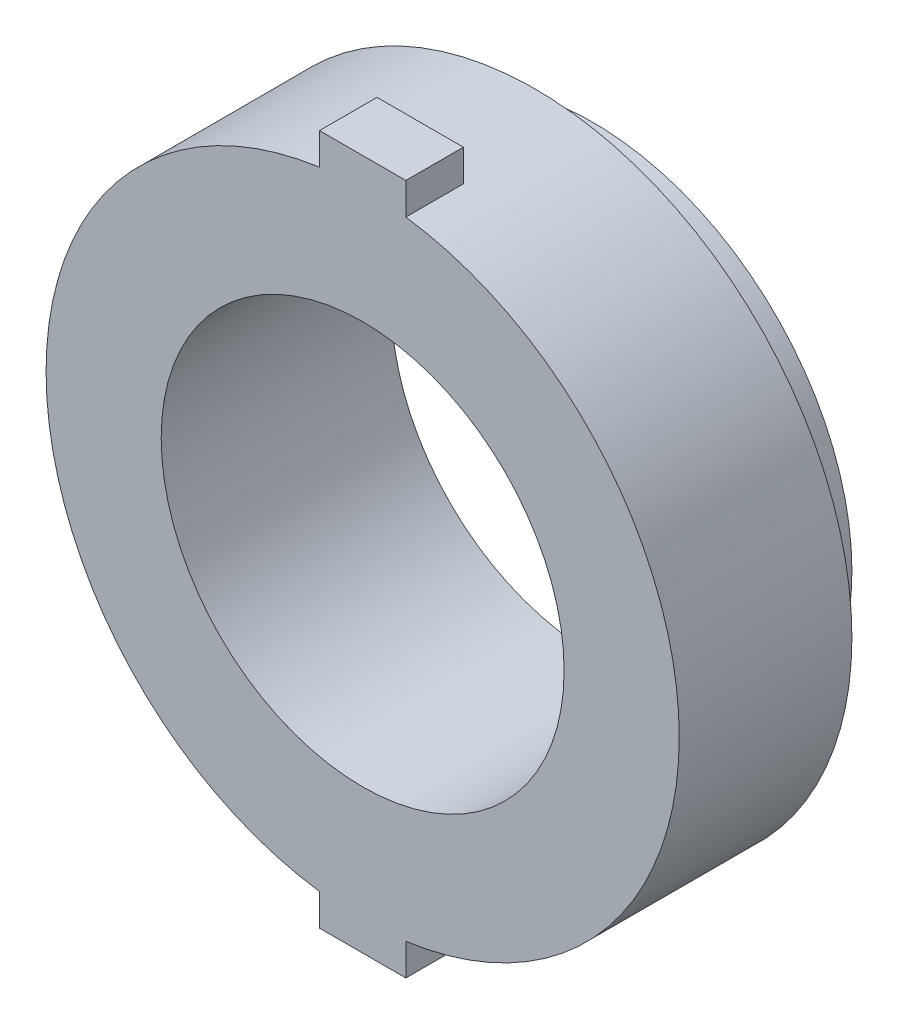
ISO-10303-21;
HEADER;
FILE_DESCRIPTION(('STEP AP214'),'2;1');
FILE_NAME('part.step','',(''),(''),'','','');
FILE_SCHEMA(('AUTOMOTIVE_DESIGN { 1 0 10303 214 1 1 1 1 }'));
ENDSEC;
DATA;
#1=APPLICATION_CONTEXT('core data for automotive mechanical design processes');
#2=APPLICATION_PROTOCOL_DEFINITION('international standard','automotive_design',2000,#1);
#3=PRODUCT_CONTEXT('',#1,'mechanical');
#4=PRODUCT('Part','Part','',(#3));
#5=PRODUCT_RELATED_PRODUCT_CATEGORY('part','',(#4));
#6=PRODUCT_DEFINITION_FORMATION('','',#4);
#7=PRODUCT_DEFINITION_CONTEXT('part definition',#1,'design');
#8=PRODUCT_DEFINITION('design','',#6,#7);
#9=PRODUCT_DEFINITION_SHAPE('','',#8);
#10=(LENGTH_UNIT() NAMED_UNIT(*) SI_UNIT(.MILLI.,.METRE.));
#11=(NAMED_UNIT(*) PLANE_ANGLE_UNIT() SI_UNIT($,.RADIAN.));
#12=(NAMED_UNIT(*) SI_UNIT($,.STERADIAN.) SOLID_ANGLE_UNIT());
#13=UNCERTAINTY_MEASURE_WITH_UNIT(LENGTH_MEASURE(1.E-05),#10,'distance_accuracy_value','');
#14=(GEOMETRIC_REPRESENTATION_CONTEXT(3) GLOBAL_UNCERTAINTY_ASSIGNED_CONTEXT((#13)) GLOBAL_UNIT_ASSIGNED_CONTEXT((#10,
#11,#12)) REPRESENTATION_CONTEXT('',''));
#15=CARTESIAN_POINT('',(0.,0.,0.));
#16=DIRECTION('',(0.,0.,1.));
#17=DIRECTION('',(1.,0.,0.));
#18=AXIS2_PLACEMENT_3D('',#15,#16,#17);
#19=CARTESIAN_POINT('',(0.,0.,0.));
#20=DIRECTION('',(0.,0.,1.));
#21=DIRECTION('',(1.,0.,0.));
#22=AXIS2_PLACEMENT_3D('',#19,#20,#21);
#23=PLANE('',#22);
#24=CARTESIAN_POINT('',(0.,0.,0.));
#25=DIRECTION('',(0.,0.,1.));
#26=DIRECTION('',(1.,0.,0.));
#27=AXIS2_PLACEMENT_3D('',#24,#25,#26);
#28=CIRCLE('',#27,5.5);
#29=CARTESIAN_POINT('',(5.5,0.,0.));
#30=VERTEX_POINT('',#29);
#31=EDGE_CURVE('E149',#30,#30,#28,.T.);
#32=ORIENTED_EDGE('',*,*,#31,.F.);
#33=EDGE_LOOP('',(#32));
#34=FACE_BOUND('',#33,.T.);
#35=CARTESIAN_POINT('',(0.,0.,0.));
#36=DIRECTION('',(0.,0.,1.));
#37=DIRECTION('',(1.,0.,0.));
#38=AXIS2_PLACEMENT_3D('',#35,#36,#37);
#39=CIRCLE('',#38,4.5);
#40=CARTESIAN_POINT('',(4.5,0.,0.));
#41=VERTEX_POINT('',#40);
#42=EDGE_CURVE('E11',#41,#41,#39,.F.);
#43=ORIENTED_EDGE('',*,*,#42,.F.);
#44=EDGE_LOOP('',(#43));
#45=FACE_BOUND('',#44,.T.);
#46=ADVANCED_FACE('F32',(#34,#45),#23,.F.);
#47=CARTESIAN_POINT('',(0.,0.,3.));
#48=DIRECTION('',(0.,0.,1.));
#49=DIRECTION('',(1.,0.,0.));
#50=AXIS2_PLACEMENT_3D('',#47,#48,#49);
#51=PLANE('',#50);
#52=CARTESIAN_POINT('',(0.,0.,3.));
#53=DIRECTION('',(0.,0.,1.));
#54=DIRECTION('',(1.,0.,0.));
#55=AXIS2_PLACEMENT_3D('',#52,#53,#54);
#56=CIRCLE('',#55,5.5);
#57=CARTESIAN_POINT('',(-0.750000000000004,5.44862367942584,3.));
#58=VERTEX_POINT('',#57);
#59=CARTESIAN_POINT('',(-0.750000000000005,-5.44862367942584,3.));
#60=VERTEX_POINT('',#59);
#61=EDGE_CURVE('E103',#58,#60,#56,.T.);
#62=ORIENTED_EDGE('',*,*,#61,.T.);
#63=DIRECTION('',(0.,-1.,0.));
#64=VECTOR('',#63,1.);
#65=CARTESIAN_POINT('',(-0.750000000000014,-4.25651707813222,3.));
#66=LINE('',#65,#64);
#67=CARTESIAN_POINT('',(-0.75,-6.,3.));
#68=VERTEX_POINT('',#67);
#69=EDGE_CURVE('E96',#60,#68,#66,.T.);
#70=ORIENTED_EDGE('',*,*,#69,.T.);
#71=DIRECTION('',(1.,0.,0.));
#72=VECTOR('',#71,1.);
#73=CARTESIAN_POINT('',(-0.75,-6.,3.));
#74=LINE('',#73,#72);
#75=CARTESIAN_POINT('',(0.749999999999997,-6.,3.));
#76=VERTEX_POINT('',#75);
#77=EDGE_CURVE('E101',#68,#76,#74,.T.);
#78=ORIENTED_EDGE('',*,*,#77,.T.);
#79=DIRECTION('',(0.,1.,0.));
#80=VECTOR('',#79,1.);
#81=CARTESIAN_POINT('',(0.749999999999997,-6.,3.));
#82=LINE('',#81,#80);
#83=CARTESIAN_POINT('',(0.749999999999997,-5.44862367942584,3.));
#84=VERTEX_POINT('',#83);
#85=EDGE_CURVE('E47',#76,#84,#82,.T.);
#86=ORIENTED_EDGE('',*,*,#85,.T.);
#87=CARTESIAN_POINT('',(0.749999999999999,5.44862367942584,3.));
#88=VERTEX_POINT('',#87);
#89=EDGE_CURVE('E152',#84,#88,#56,.T.);
#90=ORIENTED_EDGE('',*,*,#89,.T.);
#91=DIRECTION('',(0.,1.,0.));
#92=VECTOR('',#91,1.);
#93=CARTESIAN_POINT('',(0.749999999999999,6.,3.));
#94=LINE('',#93,#92);
#95=CARTESIAN_POINT('',(0.749999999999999,6.,3.));
#96=VERTEX_POINT('',#95);
#97=EDGE_CURVE('E129',#88,#96,#94,.T.);
#98=ORIENTED_EDGE('',*,*,#97,.T.);
#99=DIRECTION('',(-1.,0.,0.));
#100=VECTOR('',#99,1.);
#101=CARTESIAN_POINT('',(-0.749999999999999,6.,3.));
#102=LINE('',#101,#100);
#103=CARTESIAN_POINT('',(-0.749999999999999,6.,3.));
#104=VERTEX_POINT('',#103);
#105=EDGE_CURVE('E131',#96,#104,#102,.T.);
#106=ORIENTED_EDGE('',*,*,#105,.T.);
#107=DIRECTION('',(0.,-1.,0.));
#108=VECTOR('',#107,1.);
#109=CARTESIAN_POINT('',(-0.750000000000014,4.47203693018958,3.));
#110=LINE('',#109,#108);
#111=EDGE_CURVE('E54',#104,#58,#110,.T.);
#112=ORIENTED_EDGE('',*,*,#111,.T.);
#113=EDGE_LOOP('',(#62,#70,#78,#86,#90,#98,#106,#112));
#114=FACE_BOUND('',#113,.T.);
#115=CARTESIAN_POINT('',(0.,0.,3.));
#116=DIRECTION('',(0.,0.,1.));
#117=DIRECTION('',(1.,0.,0.));
#118=AXIS2_PLACEMENT_3D('',#115,#116,#117);
#119=CIRCLE('',#118,3.5);
#120=CARTESIAN_POINT('',(3.5,0.,3.));
#121=VERTEX_POINT('',#120);
#122=EDGE_CURVE('E144',#121,#121,#119,.T.);
#123=ORIENTED_EDGE('',*,*,#122,.F.);
#124=EDGE_LOOP('',(#123));
#125=FACE_BOUND('',#124,.T.);
#126=ADVANCED_FACE('F98',(#114,#125),#51,.T.);
#127=CARTESIAN_POINT('',(0.,0.,3.));
#128=DIRECTION('',(0.,0.,-1.));
#129=DIRECTION('',(-1.,0.,0.));
#130=AXIS2_PLACEMENT_3D('',#127,#128,#129);
#131=CYLINDRICAL_SURFACE('',#130,5.5);
#132=ORIENTED_EDGE('',*,*,#89,.F.);
#133=DIRECTION('',(0.,0.,-1.));
#134=VECTOR('',#133,1.);
#135=CARTESIAN_POINT('',(0.749999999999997,-5.44862367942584,3.));
#136=LINE('',#135,#134);
#137=CARTESIAN_POINT('',(0.749999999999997,-5.44862367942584,2.));
#138=VERTEX_POINT('',#137);
#139=EDGE_CURVE('E40',#84,#138,#136,.T.);
#140=ORIENTED_EDGE('',*,*,#139,.T.);
#141=CARTESIAN_POINT('',(0.,0.,2.));
#142=DIRECTION('',(0.,0.,-1.));
#143=DIRECTION('',(-1.,0.,0.));
#144=AXIS2_PLACEMENT_3D('',#141,#142,#143);
#145=CIRCLE('',#144,5.5);
#146=CARTESIAN_POINT('',(-0.750000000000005,-5.44862367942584,2.));
#147=VERTEX_POINT('',#146);
#148=EDGE_CURVE('E162',#138,#147,#145,.T.);
#149=ORIENTED_EDGE('',*,*,#148,.T.);
#150=DIRECTION('',(0.,0.,-1.));
#151=VECTOR('',#150,1.);
#152=CARTESIAN_POINT('',(-0.750000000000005,-5.44862367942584,3.));
#153=LINE('',#152,#151);
#154=EDGE_CURVE('E165',#147,#60,#153,.F.);
#155=ORIENTED_EDGE('',*,*,#154,.T.);
#156=ORIENTED_EDGE('',*,*,#61,.F.);
#157=DIRECTION('',(0.,0.,-1.));
#158=VECTOR('',#157,1.);
#159=CARTESIAN_POINT('',(-0.750000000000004,5.44862367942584,3.));
#160=LINE('',#159,#158);
#161=CARTESIAN_POINT('',(-0.750000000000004,5.44862367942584,2.));
#162=VERTEX_POINT('',#161);
#163=EDGE_CURVE('E159',#58,#162,#160,.T.);
#164=ORIENTED_EDGE('',*,*,#163,.T.);
#165=CARTESIAN_POINT('',(0.,0.,2.));
#166=DIRECTION('',(0.,0.,1.));
#167=DIRECTION('',(1.,0.,0.));
#168=AXIS2_PLACEMENT_3D('',#165,#166,#167);
#169=CIRCLE('',#168,5.5);
#170=CARTESIAN_POINT('',(0.749999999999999,5.44862367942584,2.));
#171=VERTEX_POINT('',#170);
#172=EDGE_CURVE('E154',#171,#162,#169,.T.);
#173=ORIENTED_EDGE('',*,*,#172,.F.);
#174=DIRECTION('',(0.,0.,-1.));
#175=VECTOR('',#174,1.);
#176=CARTESIAN_POINT('',(0.749999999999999,5.44862367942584,3.));
#177=LINE('',#176,#175);
#178=EDGE_CURVE('E156',#171,#88,#177,.F.);
#179=ORIENTED_EDGE('',*,*,#178,.T.);
#180=EDGE_LOOP('',(#132,#140,#149,#155,#156,#164,#173,#179));
#181=FACE_BOUND('',#180,.T.);
#182=ORIENTED_EDGE('',*,*,#31,.T.);
#183=EDGE_LOOP('',(#182));
#184=FACE_BOUND('',#183,.T.);
#185=ADVANCED_FACE('F34',(#181,#184),#131,.T.);
#186=CARTESIAN_POINT('',(0.,0.,3.));
#187=DIRECTION('',(0.,0.,-1.));
#188=DIRECTION('',(-1.,0.,0.));
#189=AXIS2_PLACEMENT_3D('',#186,#187,#188);
#190=CYLINDRICAL_SURFACE('',#189,3.5);
#191=ORIENTED_EDGE('',*,*,#122,.T.);
#192=EDGE_LOOP('',(#191));
#193=FACE_BOUND('',#192,.T.);
#194=CARTESIAN_POINT('',(0.,0.,-1.));
#195=DIRECTION('',(0.,0.,-1.));
#196=DIRECTION('',(-1.,0.,0.));
#197=AXIS2_PLACEMENT_3D('',#194,#195,#196);
#198=CIRCLE('',#197,3.5);
#199=CARTESIAN_POINT('',(-3.5,0.,-1.));
#200=VERTEX_POINT('',#199);
#201=EDGE_CURVE('E272',#200,#200,#198,.T.);
#202=ORIENTED_EDGE('',*,*,#201,.T.);
#203=EDGE_LOOP('',(#202));
#204=FACE_BOUND('',#203,.T.);
#205=ADVANCED_FACE('F194',(#193,#204),#190,.F.);
#206=CARTESIAN_POINT('',(-0.750000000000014,4.47203693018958,2.));
#207=DIRECTION('',(-1.,0.,0.));
#208=DIRECTION('',(0.,-1.,0.));
#209=AXIS2_PLACEMENT_3D('',#206,#207,#208);
#210=PLANE('',#209);
#211=ORIENTED_EDGE('',*,*,#163,.F.);
#212=ORIENTED_EDGE('',*,*,#111,.F.);
#213=DIRECTION('',(0.,0.,1.));
#214=VECTOR('',#213,1.);
#215=CARTESIAN_POINT('',(-0.749999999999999,6.,2.));
#216=LINE('',#215,#214);
#217=CARTESIAN_POINT('',(-0.749999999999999,6.,2.));
#218=VERTEX_POINT('',#217);
#219=EDGE_CURVE('E142',#218,#104,#216,.T.);
#220=ORIENTED_EDGE('',*,*,#219,.F.);
#221=DIRECTION('',(0.,-1.,0.));
#222=VECTOR('',#221,1.);
#223=CARTESIAN_POINT('',(-0.750000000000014,4.47203693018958,2.));
#224=LINE('',#223,#222);
#225=EDGE_CURVE('E133',#218,#162,#224,.T.);
#226=ORIENTED_EDGE('',*,*,#225,.T.);
#227=EDGE_LOOP('',(#211,#212,#220,#226));
#228=FACE_BOUND('',#227,.T.);
#229=ADVANCED_FACE('F197',(#228),#210,.T.);
#230=CARTESIAN_POINT('',(0.749999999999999,6.,2.));
#231=DIRECTION('',(1.,0.,0.));
#232=DIRECTION('',(0.,0.,-1.));
#233=AXIS2_PLACEMENT_3D('',#230,#231,#232);
#234=PLANE('',#233);
#235=ORIENTED_EDGE('',*,*,#178,.F.);
#236=DIRECTION('',(0.,1.,0.));
#237=VECTOR('',#236,1.);
#238=CARTESIAN_POINT('',(0.749999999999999,6.,2.));
#239=LINE('',#238,#237);
#240=CARTESIAN_POINT('',(0.749999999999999,6.,2.));
#241=VERTEX_POINT('',#240);
#242=EDGE_CURVE('E136',#171,#241,#239,.T.);
#243=ORIENTED_EDGE('',*,*,#242,.T.);
#244=DIRECTION('',(0.,0.,1.));
#245=VECTOR('',#244,1.);
#246=CARTESIAN_POINT('',(0.749999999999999,6.,2.));
#247=LINE('',#246,#245);
#248=EDGE_CURVE('E141',#241,#96,#247,.T.);
#249=ORIENTED_EDGE('',*,*,#248,.T.);
#250=ORIENTED_EDGE('',*,*,#97,.F.);
#251=EDGE_LOOP('',(#235,#243,#249,#250));
#252=FACE_BOUND('',#251,.T.);
#253=ADVANCED_FACE('F201',(#252),#234,.T.);
#254=CARTESIAN_POINT('',(-0.750000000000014,4.47203693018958,2.));
#255=DIRECTION('',(0.,0.,1.));
#256=DIRECTION('',(1.,0.,0.));
#257=AXIS2_PLACEMENT_3D('',#254,#255,#256);
#258=PLANE('',#257);
#259=ORIENTED_EDGE('',*,*,#242,.F.);
#260=ORIENTED_EDGE('',*,*,#172,.T.);
#261=ORIENTED_EDGE('',*,*,#225,.F.);
#262=DIRECTION('',(-1.,0.,0.));
#263=VECTOR('',#262,1.);
#264=CARTESIAN_POINT('',(-0.749999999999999,6.,2.));
#265=LINE('',#264,#263);
#266=EDGE_CURVE('E138',#241,#218,#265,.T.);
#267=ORIENTED_EDGE('',*,*,#266,.F.);
#268=EDGE_LOOP('',(#259,#260,#261,#267));
#269=FACE_BOUND('',#268,.T.);
#270=ADVANCED_FACE('F205',(#269),#258,.F.);
#271=CARTESIAN_POINT('',(-0.749999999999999,6.,2.));
#272=DIRECTION('',(0.,1.,0.));
#273=DIRECTION('',(-1.,0.,0.));
#274=AXIS2_PLACEMENT_3D('',#271,#272,#273);
#275=PLANE('',#274);
#276=ORIENTED_EDGE('',*,*,#105,.F.);
#277=ORIENTED_EDGE('',*,*,#248,.F.);
#278=ORIENTED_EDGE('',*,*,#266,.T.);
#279=ORIENTED_EDGE('',*,*,#219,.T.);
#280=EDGE_LOOP('',(#276,#277,#278,#279));
#281=FACE_BOUND('',#280,.T.);
#282=ADVANCED_FACE('F207',(#281),#275,.T.);
#283=CARTESIAN_POINT('',(0.749999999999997,-6.,2.));
#284=DIRECTION('',(1.,0.,0.));
#285=DIRECTION('',(0.,0.,-1.));
#286=AXIS2_PLACEMENT_3D('',#283,#284,#285);
#287=PLANE('',#286);
#288=ORIENTED_EDGE('',*,*,#139,.F.);
#289=ORIENTED_EDGE('',*,*,#85,.F.);
#290=DIRECTION('',(0.,0.,1.));
#291=VECTOR('',#290,1.);
#292=CARTESIAN_POINT('',(0.749999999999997,-6.,2.));
#293=LINE('',#292,#291);
#294=CARTESIAN_POINT('',(0.749999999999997,-6.,2.));
#295=VERTEX_POINT('',#294);
#296=EDGE_CURVE('E115',#295,#76,#293,.T.);
#297=ORIENTED_EDGE('',*,*,#296,.F.);
#298=DIRECTION('',(0.,1.,0.));
#299=VECTOR('',#298,1.);
#300=CARTESIAN_POINT('',(0.749999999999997,-6.,2.));
#301=LINE('',#300,#299);
#302=EDGE_CURVE('E119',#295,#138,#301,.T.);
#303=ORIENTED_EDGE('',*,*,#302,.T.);
#304=EDGE_LOOP('',(#288,#289,#297,#303));
#305=FACE_BOUND('',#304,.T.);
#306=ADVANCED_FACE('F171',(#305),#287,.T.);
#307=CARTESIAN_POINT('',(-0.750000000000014,-4.25651707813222,2.));
#308=DIRECTION('',(-1.,0.,0.));
#309=DIRECTION('',(0.,-1.,0.));
#310=AXIS2_PLACEMENT_3D('',#307,#308,#309);
#311=PLANE('',#310);
#312=ORIENTED_EDGE('',*,*,#154,.F.);
#313=DIRECTION('',(0.,-1.,0.));
#314=VECTOR('',#313,1.);
#315=CARTESIAN_POINT('',(-0.750000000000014,-4.25651707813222,2.));
#316=LINE('',#315,#314);
#317=CARTESIAN_POINT('',(-0.75,-6.,2.));
#318=VERTEX_POINT('',#317);
#319=EDGE_CURVE('E111',#147,#318,#316,.T.);
#320=ORIENTED_EDGE('',*,*,#319,.T.);
#321=DIRECTION('',(0.,0.,1.));
#322=VECTOR('',#321,1.);
#323=CARTESIAN_POINT('',(-0.75,-6.,2.));
#324=LINE('',#323,#322);
#325=EDGE_CURVE('E108',#318,#68,#324,.T.);
#326=ORIENTED_EDGE('',*,*,#325,.T.);
#327=ORIENTED_EDGE('',*,*,#69,.F.);
#328=EDGE_LOOP('',(#312,#320,#326,#327));
#329=FACE_BOUND('',#328,.T.);
#330=ADVANCED_FACE('F109',(#329),#311,.T.);
#331=CARTESIAN_POINT('',(0.749999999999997,-6.,2.));
#332=DIRECTION('',(0.,0.,-1.));
#333=DIRECTION('',(-1.,0.,0.));
#334=AXIS2_PLACEMENT_3D('',#331,#332,#333);
#335=PLANE('',#334);
#336=ORIENTED_EDGE('',*,*,#148,.F.);
#337=ORIENTED_EDGE('',*,*,#302,.F.);
#338=DIRECTION('',(1.,0.,0.));
#339=VECTOR('',#338,1.);
#340=CARTESIAN_POINT('',(-0.75,-6.,2.));
#341=LINE('',#340,#339);
#342=EDGE_CURVE('E116',#318,#295,#341,.T.);
#343=ORIENTED_EDGE('',*,*,#342,.F.);
#344=ORIENTED_EDGE('',*,*,#319,.F.);
#345=EDGE_LOOP('',(#336,#337,#343,#344));
#346=FACE_BOUND('',#345,.T.);
#347=ADVANCED_FACE('F174',(#346),#335,.T.);
#348=CARTESIAN_POINT('',(-0.75,-6.,2.));
#349=DIRECTION('',(0.,-1.,0.));
#350=DIRECTION('',(0.,0.,-1.));
#351=AXIS2_PLACEMENT_3D('',#348,#349,#350);
#352=PLANE('',#351);
#353=ORIENTED_EDGE('',*,*,#77,.F.);
#354=ORIENTED_EDGE('',*,*,#325,.F.);
#355=ORIENTED_EDGE('',*,*,#342,.T.);
#356=ORIENTED_EDGE('',*,*,#296,.T.);
#357=EDGE_LOOP('',(#353,#354,#355,#356));
#358=FACE_BOUND('',#357,.T.);
#359=ADVANCED_FACE('F118',(#358),#352,.T.);
#360=CARTESIAN_POINT('',(0.,0.,-1.));
#361=DIRECTION('',(0.,0.,-1.));
#362=DIRECTION('',(-1.,0.,0.));
#363=AXIS2_PLACEMENT_3D('',#360,#361,#362);
#364=PLANE('',#363);
#365=CARTESIAN_POINT('',(0.,0.,-1.));
#366=DIRECTION('',(0.,0.,-1.));
#367=DIRECTION('',(-1.,0.,0.));
#368=AXIS2_PLACEMENT_3D('',#365,#366,#367);
#369=CIRCLE('',#368,4.5);
#370=CARTESIAN_POINT('',(-4.5,0.,-1.));
#371=VERTEX_POINT('',#370);
#372=EDGE_CURVE('E270',#371,#371,#369,.T.);
#373=ORIENTED_EDGE('',*,*,#372,.T.);
#374=EDGE_LOOP('',(#373));
#375=FACE_BOUND('',#374,.T.);
#376=ORIENTED_EDGE('',*,*,#201,.F.);
#377=EDGE_LOOP('',(#376));
#378=FACE_BOUND('',#377,.T.);
#379=ADVANCED_FACE('F181',(#375,#378),#364,.T.);
#380=CARTESIAN_POINT('',(0.,0.,-1.));
#381=DIRECTION('',(0.,0.,1.));
#382=DIRECTION('',(1.,0.,0.));
#383=AXIS2_PLACEMENT_3D('',#380,#381,#382);
#384=CYLINDRICAL_SURFACE('',#383,4.5);
#385=ORIENTED_EDGE('',*,*,#372,.F.);
#386=EDGE_LOOP('',(#385));
#387=FACE_BOUND('',#386,.T.);
#388=ORIENTED_EDGE('',*,*,#42,.T.);
#389=EDGE_LOOP('',(#388));
#390=FACE_BOUND('',#389,.T.);
#391=ADVANCED_FACE('F254',(#387,#390),#384,.T.);
#392=CLOSED_SHELL('',(#46,#126,#185,#205,#229,#253,#270,#282,#306,#330,#347,#359,#379,#391));
#393=MANIFOLD_SOLID_BREP('B2',#392);
#394=ADVANCED_BREP_SHAPE_REPRESENTATION('',(#18,#393),#14);
#395=SHAPE_DEFINITION_REPRESENTATION(#9,#394);
ENDSEC;
END-ISO-10303-21;
